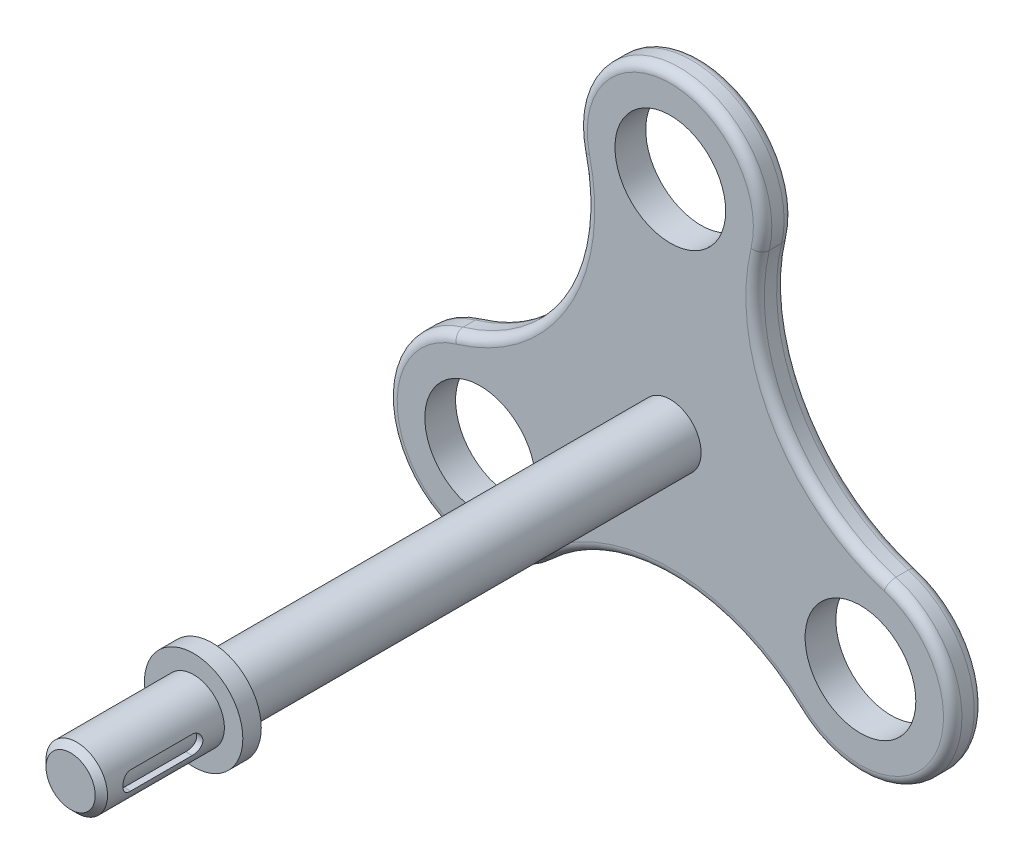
ISO-10303-21;
HEADER;
FILE_DESCRIPTION(('STEP AP214'),'2;1');
FILE_NAME('part.step','',(''),(''),'','','');
FILE_SCHEMA(('AUTOMOTIVE_DESIGN { 1 0 10303 214 1 1 1 1 }'));
ENDSEC;
DATA;
#1=APPLICATION_CONTEXT('core data for automotive mechanical design processes');
#2=APPLICATION_PROTOCOL_DEFINITION('international standard','automotive_design',2000,#1);
#3=PRODUCT_CONTEXT('',#1,'mechanical');
#4=PRODUCT('Part','Part','',(#3));
#5=PRODUCT_RELATED_PRODUCT_CATEGORY('part','',(#4));
#6=PRODUCT_DEFINITION_FORMATION('','',#4);
#7=PRODUCT_DEFINITION_CONTEXT('part definition',#1,'design');
#8=PRODUCT_DEFINITION('design','',#6,#7);
#9=PRODUCT_DEFINITION_SHAPE('','',#8);
#10=(LENGTH_UNIT() NAMED_UNIT(*) SI_UNIT(.MILLI.,.METRE.));
#11=(NAMED_UNIT(*) PLANE_ANGLE_UNIT() SI_UNIT($,.RADIAN.));
#12=(NAMED_UNIT(*) SI_UNIT($,.STERADIAN.) SOLID_ANGLE_UNIT());
#13=UNCERTAINTY_MEASURE_WITH_UNIT(LENGTH_MEASURE(1.E-05),#10,'distance_accuracy_value','');
#14=(GEOMETRIC_REPRESENTATION_CONTEXT(3) GLOBAL_UNCERTAINTY_ASSIGNED_CONTEXT((#13)) GLOBAL_UNIT_ASSIGNED_CONTEXT((#10,
#11,#12)) REPRESENTATION_CONTEXT('',''));
#15=CARTESIAN_POINT('',(0.,0.,0.));
#16=DIRECTION('',(0.,0.,1.));
#17=DIRECTION('',(1.,0.,0.));
#18=AXIS2_PLACEMENT_3D('',#15,#16,#17);
#19=CARTESIAN_POINT('',(15.4557654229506,-8.77017098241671,1.25));
#20=DIRECTION('',(0.,0.,-1.));
#21=DIRECTION('',(-1.,0.,0.));
#22=AXIS2_PLACEMENT_3D('',#19,#20,#21);
#23=CYLINDRICAL_SURFACE('',#22,7.5);
#24=DIRECTION('',(0.,0.,-1.));
#25=VECTOR('',#24,1.);
#26=CARTESIAN_POINT('',(10.3038436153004,-14.2206481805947,1.25));
#27=LINE('',#26,#25);
#28=CARTESIAN_POINT('',(10.3038436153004,-14.2206481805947,0.5));
#29=VERTEX_POINT('',#28);
#30=CARTESIAN_POINT('',(10.3038436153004,-14.2206481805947,-0.5));
#31=VERTEX_POINT('',#30);
#32=EDGE_CURVE('E342',#29,#31,#27,.T.);
#33=ORIENTED_EDGE('',*,*,#32,.T.);
#34=CARTESIAN_POINT('',(15.4557654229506,-8.77017098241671,-0.5));
#35=DIRECTION('',(0.,0.,1.));
#36=DIRECTION('',(1.,0.,0.));
#37=AXIS2_PLACEMENT_3D('',#34,#35,#36);
#38=CIRCLE('',#37,7.5);
#39=CARTESIAN_POINT('',(17.6000562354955,-1.5832372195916,-0.5));
#40=VERTEX_POINT('',#39);
#41=EDGE_CURVE('E315',#31,#40,#38,.T.);
#42=ORIENTED_EDGE('',*,*,#41,.T.);
#43=DIRECTION('',(0.,0.,-1.));
#44=VECTOR('',#43,1.);
#45=CARTESIAN_POINT('',(17.6000562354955,-1.5832372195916,1.25));
#46=LINE('',#45,#44);
#47=CARTESIAN_POINT('',(17.6000562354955,-1.5832372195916,0.5));
#48=VERTEX_POINT('',#47);
#49=EDGE_CURVE('E348',#48,#40,#46,.T.);
#50=ORIENTED_EDGE('',*,*,#49,.F.);
#51=CARTESIAN_POINT('',(15.4557654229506,-8.77017098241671,0.5));
#52=DIRECTION('',(0.,0.,1.));
#53=DIRECTION('',(1.,0.,0.));
#54=AXIS2_PLACEMENT_3D('',#51,#52,#53);
#55=CIRCLE('',#54,7.5);
#56=EDGE_CURVE('E317',#48,#29,#55,.F.);
#57=ORIENTED_EDGE('',*,*,#56,.T.);
#58=EDGE_LOOP('',(#33,#42,#50,#57));
#59=FACE_BOUND('',#58,.T.);
#60=ADVANCED_FACE('F58',(#59),#23,.T.);
#61=CARTESIAN_POINT('',(21.8886378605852,12.7906303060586,1.25));
#62=DIRECTION('',(0.,0.,-1.));
#63=DIRECTION('',(-1.,0.,0.));
#64=AXIS2_PLACEMENT_3D('',#61,#62,#63);
#65=CYLINDRICAL_SURFACE('',#64,15.);
#66=ORIENTED_EDGE('',*,*,#49,.T.);
#67=CARTESIAN_POINT('',(21.8886378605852,12.7906303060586,-0.5));
#68=DIRECTION('',(0.,0.,1.));
#69=DIRECTION('',(1.,0.,0.));
#70=AXIS2_PLACEMENT_3D('',#67,#68,#69);
#71=CIRCLE('',#70,15.);
#72=CARTESIAN_POINT('',(7.29621262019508,16.2635434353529,-0.5));
#73=VERTEX_POINT('',#72);
#74=EDGE_CURVE('E311',#40,#73,#71,.F.);
#75=ORIENTED_EDGE('',*,*,#74,.T.);
#76=DIRECTION('',(0.,0.,-1.));
#77=VECTOR('',#76,1.);
#78=CARTESIAN_POINT('',(7.29621262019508,16.2635434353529,1.25));
#79=LINE('',#78,#77);
#80=CARTESIAN_POINT('',(7.29621262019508,16.2635434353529,0.5));
#81=VERTEX_POINT('',#80);
#82=EDGE_CURVE('E351',#81,#73,#79,.T.);
#83=ORIENTED_EDGE('',*,*,#82,.F.);
#84=CARTESIAN_POINT('',(21.8886378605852,12.7906303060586,0.5));
#85=DIRECTION('',(0.,0.,1.));
#86=DIRECTION('',(1.,0.,0.));
#87=AXIS2_PLACEMENT_3D('',#84,#85,#86);
#88=CIRCLE('',#87,15.);
#89=EDGE_CURVE('E313',#81,#48,#88,.T.);
#90=ORIENTED_EDGE('',*,*,#89,.T.);
#91=EDGE_LOOP('',(#66,#75,#83,#90));
#92=FACE_BOUND('',#91,.T.);
#93=ADVANCED_FACE('F397',(#92),#65,.F.);
#94=CARTESIAN_POINT('',(0.,18.,1.25));
#95=DIRECTION('',(0.,0.,-1.));
#96=DIRECTION('',(-1.,0.,0.));
#97=AXIS2_PLACEMENT_3D('',#94,#95,#96);
#98=CYLINDRICAL_SURFACE('',#97,7.5);
#99=ORIENTED_EDGE('',*,*,#82,.T.);
#100=CARTESIAN_POINT('',(0.,18.,-0.5));
#101=DIRECTION('',(0.,0.,1.));
#102=DIRECTION('',(1.,0.,0.));
#103=AXIS2_PLACEMENT_3D('',#100,#101,#102);
#104=CIRCLE('',#103,7.5);
#105=CARTESIAN_POINT('',(-7.29621262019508,16.2635434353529,-0.5));
#106=VERTEX_POINT('',#105);
#107=EDGE_CURVE('E307',#73,#106,#104,.T.);
#108=ORIENTED_EDGE('',*,*,#107,.T.);
#109=DIRECTION('',(0.,0.,-1.));
#110=VECTOR('',#109,1.);
#111=CARTESIAN_POINT('',(-7.29621262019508,16.2635434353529,1.25));
#112=LINE('',#111,#110);
#113=CARTESIAN_POINT('',(-7.29621262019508,16.2635434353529,0.5));
#114=VERTEX_POINT('',#113);
#115=EDGE_CURVE('E354',#114,#106,#112,.T.);
#116=ORIENTED_EDGE('',*,*,#115,.F.);
#117=CARTESIAN_POINT('',(0.,18.,0.5));
#118=DIRECTION('',(0.,0.,1.));
#119=DIRECTION('',(1.,0.,0.));
#120=AXIS2_PLACEMENT_3D('',#117,#118,#119);
#121=CIRCLE('',#120,7.5);
#122=EDGE_CURVE('E309',#114,#81,#121,.F.);
#123=ORIENTED_EDGE('',*,*,#122,.T.);
#124=EDGE_LOOP('',(#99,#108,#116,#123));
#125=FACE_BOUND('',#124,.T.);
#126=ADVANCED_FACE('F403',(#125),#98,.T.);
#127=CARTESIAN_POINT('',(-21.8886378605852,12.7906303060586,1.25));
#128=DIRECTION('',(0.,0.,-1.));
#129=DIRECTION('',(-1.,0.,0.));
#130=AXIS2_PLACEMENT_3D('',#127,#128,#129);
#131=CYLINDRICAL_SURFACE('',#130,15.);
#132=ORIENTED_EDGE('',*,*,#115,.T.);
#133=CARTESIAN_POINT('',(-21.8886378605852,12.7906303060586,-0.5));
#134=DIRECTION('',(0.,0.,1.));
#135=DIRECTION('',(1.,0.,0.));
#136=AXIS2_PLACEMENT_3D('',#133,#134,#135);
#137=CIRCLE('',#136,15.);
#138=CARTESIAN_POINT('',(-17.6000562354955,-1.5832372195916,-0.5));
#139=VERTEX_POINT('',#138);
#140=EDGE_CURVE('E257',#106,#139,#137,.F.);
#141=ORIENTED_EDGE('',*,*,#140,.T.);
#142=DIRECTION('',(0.,0.,-1.));
#143=VECTOR('',#142,1.);
#144=CARTESIAN_POINT('',(-17.6000562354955,-1.5832372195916,1.25));
#145=LINE('',#144,#143);
#146=CARTESIAN_POINT('',(-17.6000562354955,-1.5832372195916,0.5));
#147=VERTEX_POINT('',#146);
#148=EDGE_CURVE('E357',#147,#139,#145,.T.);
#149=ORIENTED_EDGE('',*,*,#148,.F.);
#150=CARTESIAN_POINT('',(-21.8886378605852,12.7906303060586,0.5));
#151=DIRECTION('',(0.,0.,1.));
#152=DIRECTION('',(1.,0.,0.));
#153=AXIS2_PLACEMENT_3D('',#150,#151,#152);
#154=CIRCLE('',#153,15.);
#155=EDGE_CURVE('E292',#147,#114,#154,.T.);
#156=ORIENTED_EDGE('',*,*,#155,.T.);
#157=EDGE_LOOP('',(#132,#141,#149,#156));
#158=FACE_BOUND('',#157,.T.);
#159=ADVANCED_FACE('F518',(#158),#131,.F.);
#160=CARTESIAN_POINT('',(-15.4557654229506,-8.77017098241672,1.25));
#161=DIRECTION('',(0.,0.,-1.));
#162=DIRECTION('',(-1.,0.,0.));
#163=AXIS2_PLACEMENT_3D('',#160,#161,#162);
#164=CYLINDRICAL_SURFACE('',#163,7.5);
#165=ORIENTED_EDGE('',*,*,#148,.T.);
#166=CARTESIAN_POINT('',(-15.4557654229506,-8.77017098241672,-0.5));
#167=DIRECTION('',(0.,0.,1.));
#168=DIRECTION('',(1.,0.,0.));
#169=AXIS2_PLACEMENT_3D('',#166,#167,#168);
#170=CIRCLE('',#169,7.5);
#171=CARTESIAN_POINT('',(-10.3038436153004,-14.2206481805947,-0.5));
#172=VERTEX_POINT('',#171);
#173=EDGE_CURVE('E323',#139,#172,#170,.T.);
#174=ORIENTED_EDGE('',*,*,#173,.T.);
#175=DIRECTION('',(0.,0.,-1.));
#176=VECTOR('',#175,1.);
#177=CARTESIAN_POINT('',(-10.3038436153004,-14.2206481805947,1.25));
#178=LINE('',#177,#176);
#179=CARTESIAN_POINT('',(-10.3038436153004,-14.2206481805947,0.5));
#180=VERTEX_POINT('',#179);
#181=EDGE_CURVE('E360',#180,#172,#178,.T.);
#182=ORIENTED_EDGE('',*,*,#181,.F.);
#183=CARTESIAN_POINT('',(-15.4557654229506,-8.77017098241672,0.5));
#184=DIRECTION('',(0.,0.,1.));
#185=DIRECTION('',(1.,0.,0.));
#186=AXIS2_PLACEMENT_3D('',#183,#184,#185);
#187=CIRCLE('',#186,7.5);
#188=EDGE_CURVE('E326',#180,#147,#187,.F.);
#189=ORIENTED_EDGE('',*,*,#188,.T.);
#190=EDGE_LOOP('',(#165,#174,#182,#189));
#191=FACE_BOUND('',#190,.T.);
#192=ADVANCED_FACE('F412',(#191),#164,.T.);
#193=CARTESIAN_POINT('',(0.,-25.1216025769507,1.25));
#194=DIRECTION('',(0.,0.,-1.));
#195=DIRECTION('',(-1.,0.,0.));
#196=AXIS2_PLACEMENT_3D('',#193,#194,#195);
#197=CYLINDRICAL_SURFACE('',#196,15.);
#198=ORIENTED_EDGE('',*,*,#181,.T.);
#199=CARTESIAN_POINT('',(0.,-25.1216025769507,-0.5));
#200=DIRECTION('',(0.,0.,1.));
#201=DIRECTION('',(1.,0.,0.));
#202=AXIS2_PLACEMENT_3D('',#199,#200,#201);
#203=CIRCLE('',#202,15.);
#204=EDGE_CURVE('E319',#172,#31,#203,.F.);
#205=ORIENTED_EDGE('',*,*,#204,.T.);
#206=ORIENTED_EDGE('',*,*,#32,.F.);
#207=CARTESIAN_POINT('',(0.,-25.1216025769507,0.5));
#208=DIRECTION('',(0.,0.,1.));
#209=DIRECTION('',(1.,0.,0.));
#210=AXIS2_PLACEMENT_3D('',#207,#208,#209);
#211=CIRCLE('',#210,15.);
#212=EDGE_CURVE('E321',#29,#180,#211,.T.);
#213=ORIENTED_EDGE('',*,*,#212,.T.);
#214=EDGE_LOOP('',(#198,#205,#206,#213));
#215=FACE_BOUND('',#214,.T.);
#216=ADVANCED_FACE('F408',(#215),#197,.F.);
#217=CARTESIAN_POINT('',(-15.4557654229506,-8.77017098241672,1.25));
#218=DIRECTION('',(0.,0.,-1.));
#219=DIRECTION('',(-1.,0.,0.));
#220=AXIS2_PLACEMENT_3D('',#217,#218,#219);
#221=CYLINDRICAL_SURFACE('',#220,4.5);
#222=CARTESIAN_POINT('',(-15.4557654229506,-8.77017098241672,1.25));
#223=DIRECTION('',(0.,0.,1.));
#224=DIRECTION('',(1.,0.,0.));
#225=AXIS2_PLACEMENT_3D('',#222,#223,#224);
#226=CIRCLE('',#225,4.5);
#227=CARTESIAN_POINT('',(-10.9557654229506,-8.77017098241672,1.25));
#228=VERTEX_POINT('',#227);
#229=EDGE_CURVE('E363',#228,#228,#226,.T.);
#230=ORIENTED_EDGE('',*,*,#229,.T.);
#231=EDGE_LOOP('',(#230));
#232=FACE_BOUND('',#231,.T.);
#233=CARTESIAN_POINT('',(-15.4557654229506,-8.77017098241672,-1.25));
#234=DIRECTION('',(0.,0.,1.));
#235=DIRECTION('',(1.,0.,0.));
#236=AXIS2_PLACEMENT_3D('',#233,#234,#235);
#237=CIRCLE('',#236,4.5);
#238=CARTESIAN_POINT('',(-10.9557654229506,-8.77017098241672,-1.25));
#239=VERTEX_POINT('',#238);
#240=EDGE_CURVE('E364',#239,#239,#237,.T.);
#241=ORIENTED_EDGE('',*,*,#240,.F.);
#242=EDGE_LOOP('',(#241));
#243=FACE_BOUND('',#242,.T.);
#244=ADVANCED_FACE('F411',(#232,#243),#221,.F.);
#245=CARTESIAN_POINT('',(15.4557654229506,-8.77017098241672,1.25));
#246=DIRECTION('',(0.,0.,-1.));
#247=DIRECTION('',(-1.,0.,0.));
#248=AXIS2_PLACEMENT_3D('',#245,#246,#247);
#249=CYLINDRICAL_SURFACE('',#248,4.5);
#250=CARTESIAN_POINT('',(15.4557654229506,-8.77017098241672,1.25));
#251=DIRECTION('',(0.,0.,1.));
#252=DIRECTION('',(1.,0.,0.));
#253=AXIS2_PLACEMENT_3D('',#250,#251,#252);
#254=CIRCLE('',#253,4.5);
#255=CARTESIAN_POINT('',(19.9557654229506,-8.77017098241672,1.25));
#256=VERTEX_POINT('',#255);
#257=EDGE_CURVE('E375',#256,#256,#254,.T.);
#258=ORIENTED_EDGE('',*,*,#257,.T.);
#259=EDGE_LOOP('',(#258));
#260=FACE_BOUND('',#259,.T.);
#261=CARTESIAN_POINT('',(15.4557654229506,-8.77017098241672,-1.25));
#262=DIRECTION('',(0.,0.,1.));
#263=DIRECTION('',(1.,0.,0.));
#264=AXIS2_PLACEMENT_3D('',#261,#262,#263);
#265=CIRCLE('',#264,4.5);
#266=CARTESIAN_POINT('',(19.9557654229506,-8.77017098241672,-1.25));
#267=VERTEX_POINT('',#266);
#268=EDGE_CURVE('E368',#267,#267,#265,.T.);
#269=ORIENTED_EDGE('',*,*,#268,.F.);
#270=EDGE_LOOP('',(#269));
#271=FACE_BOUND('',#270,.T.);
#272=ADVANCED_FACE('F416',(#260,#271),#249,.F.);
#273=CARTESIAN_POINT('',(0.,18.,1.25));
#274=DIRECTION('',(0.,0.,-1.));
#275=DIRECTION('',(-1.,0.,0.));
#276=AXIS2_PLACEMENT_3D('',#273,#274,#275);
#277=CYLINDRICAL_SURFACE('',#276,4.5);
#278=CARTESIAN_POINT('',(0.,18.,1.25));
#279=DIRECTION('',(0.,0.,1.));
#280=DIRECTION('',(1.,0.,0.));
#281=AXIS2_PLACEMENT_3D('',#278,#279,#280);
#282=CIRCLE('',#281,4.5);
#283=CARTESIAN_POINT('',(4.5,18.,1.25));
#284=VERTEX_POINT('',#283);
#285=EDGE_CURVE('E367',#284,#284,#282,.T.);
#286=ORIENTED_EDGE('',*,*,#285,.T.);
#287=EDGE_LOOP('',(#286));
#288=FACE_BOUND('',#287,.T.);
#289=CARTESIAN_POINT('',(0.,18.,-1.25));
#290=DIRECTION('',(0.,0.,1.));
#291=DIRECTION('',(1.,0.,0.));
#292=AXIS2_PLACEMENT_3D('',#289,#290,#291);
#293=CIRCLE('',#292,4.5);
#294=CARTESIAN_POINT('',(4.5,18.,-1.25));
#295=VERTEX_POINT('',#294);
#296=EDGE_CURVE('E345',#295,#295,#293,.T.);
#297=ORIENTED_EDGE('',*,*,#296,.F.);
#298=EDGE_LOOP('',(#297));
#299=FACE_BOUND('',#298,.T.);
#300=ADVANCED_FACE('F420',(#288,#299),#277,.F.);
#301=CARTESIAN_POINT('',(0.,0.,-1.25));
#302=DIRECTION('',(0.,0.,1.));
#303=DIRECTION('',(1.,0.,0.));
#304=AXIS2_PLACEMENT_3D('',#301,#302,#303);
#305=PLANE('',#304);
#306=CARTESIAN_POINT('',(0.,-25.1216025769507,-1.25));
#307=DIRECTION('',(0.,0.,1.));
#308=DIRECTION('',(1.,0.,0.));
#309=AXIS2_PLACEMENT_3D('',#306,#307,#308);
#310=CIRCLE('',#309,15.75);
#311=CARTESIAN_POINT('',(10.8190357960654,-13.6756004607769,-1.25));
#312=VERTEX_POINT('',#311);
#313=CARTESIAN_POINT('',(-10.8190357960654,-13.6756004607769,-1.25));
#314=VERTEX_POINT('',#313);
#315=EDGE_CURVE('E332',#312,#314,#310,.T.);
#316=ORIENTED_EDGE('',*,*,#315,.T.);
#317=CARTESIAN_POINT('',(-15.4557654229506,-8.77017098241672,-1.25));
#318=DIRECTION('',(0.,0.,1.));
#319=DIRECTION('',(1.,0.,0.));
#320=AXIS2_PLACEMENT_3D('',#317,#318,#319);
#321=CIRCLE('',#320,6.75);
#322=CARTESIAN_POINT('',(-17.385627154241,-2.30193059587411,-1.25));
#323=VERTEX_POINT('',#322);
#324=EDGE_CURVE('E329',#314,#323,#321,.F.);
#325=ORIENTED_EDGE('',*,*,#324,.T.);
#326=CARTESIAN_POINT('',(-21.8886378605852,12.7906303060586,-1.25));
#327=DIRECTION('',(0.,0.,1.));
#328=DIRECTION('',(1.,0.,0.));
#329=AXIS2_PLACEMENT_3D('',#326,#327,#328);
#330=CIRCLE('',#329,15.75);
#331=CARTESIAN_POINT('',(-6.56659135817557,16.4371890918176,-1.25));
#332=VERTEX_POINT('',#331);
#333=EDGE_CURVE('E340',#323,#332,#330,.T.);
#334=ORIENTED_EDGE('',*,*,#333,.T.);
#335=CARTESIAN_POINT('',(0.,18.,-1.25));
#336=DIRECTION('',(0.,0.,1.));
#337=DIRECTION('',(1.,0.,0.));
#338=AXIS2_PLACEMENT_3D('',#335,#336,#337);
#339=CIRCLE('',#338,6.75);
#340=CARTESIAN_POINT('',(6.56659135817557,16.4371890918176,-1.25));
#341=VERTEX_POINT('',#340);
#342=EDGE_CURVE('E338',#332,#341,#339,.F.);
#343=ORIENTED_EDGE('',*,*,#342,.T.);
#344=CARTESIAN_POINT('',(21.8886378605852,12.7906303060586,-1.25));
#345=DIRECTION('',(0.,0.,1.));
#346=DIRECTION('',(1.,0.,0.));
#347=AXIS2_PLACEMENT_3D('',#344,#345,#346);
#348=CIRCLE('',#347,15.75);
#349=CARTESIAN_POINT('',(17.385627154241,-2.30193059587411,-1.25));
#350=VERTEX_POINT('',#349);
#351=EDGE_CURVE('E336',#341,#350,#348,.T.);
#352=ORIENTED_EDGE('',*,*,#351,.T.);
#353=CARTESIAN_POINT('',(15.4557654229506,-8.77017098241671,-1.25));
#354=DIRECTION('',(0.,0.,1.));
#355=DIRECTION('',(1.,0.,0.));
#356=AXIS2_PLACEMENT_3D('',#353,#354,#355);
#357=CIRCLE('',#356,6.75);
#358=EDGE_CURVE('E334',#350,#312,#357,.F.);
#359=ORIENTED_EDGE('',*,*,#358,.T.);
#360=EDGE_LOOP('',(#316,#325,#334,#343,#352,#359));
#361=FACE_BOUND('',#360,.T.);
#362=ORIENTED_EDGE('',*,*,#296,.T.);
#363=EDGE_LOOP('',(#362));
#364=FACE_BOUND('',#363,.T.);
#365=ORIENTED_EDGE('',*,*,#268,.T.);
#366=EDGE_LOOP('',(#365));
#367=FACE_BOUND('',#366,.T.);
#368=ORIENTED_EDGE('',*,*,#240,.T.);
#369=EDGE_LOOP('',(#368));
#370=FACE_BOUND('',#369,.T.);
#371=ADVANCED_FACE('F424',(#361,#364,#367,#370),#305,.F.);
#372=CARTESIAN_POINT('',(0.,0.,1.25));
#373=DIRECTION('',(0.,0.,1.));
#374=DIRECTION('',(1.,0.,0.));
#375=AXIS2_PLACEMENT_3D('',#372,#373,#374);
#376=PLANE('',#375);
#377=CARTESIAN_POINT('',(-21.8886378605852,12.7906303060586,1.25));
#378=DIRECTION('',(0.,0.,1.));
#379=DIRECTION('',(1.,0.,0.));
#380=AXIS2_PLACEMENT_3D('',#377,#378,#379);
#381=CIRCLE('',#380,15.75);
#382=CARTESIAN_POINT('',(-6.56659135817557,16.4371890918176,1.25));
#383=VERTEX_POINT('',#382);
#384=CARTESIAN_POINT('',(-17.385627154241,-2.30193059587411,1.25));
#385=VERTEX_POINT('',#384);
#386=EDGE_CURVE('E305',#383,#385,#381,.F.);
#387=ORIENTED_EDGE('',*,*,#386,.T.);
#388=CARTESIAN_POINT('',(-15.4557654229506,-8.77017098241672,1.25));
#389=DIRECTION('',(0.,0.,1.));
#390=DIRECTION('',(1.,0.,0.));
#391=AXIS2_PLACEMENT_3D('',#388,#389,#390);
#392=CIRCLE('',#391,6.75);
#393=CARTESIAN_POINT('',(-10.8190357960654,-13.6756004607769,1.25));
#394=VERTEX_POINT('',#393);
#395=EDGE_CURVE('E294',#385,#394,#392,.T.);
#396=ORIENTED_EDGE('',*,*,#395,.T.);
#397=CARTESIAN_POINT('',(0.,-25.1216025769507,1.25));
#398=DIRECTION('',(0.,0.,1.));
#399=DIRECTION('',(1.,0.,0.));
#400=AXIS2_PLACEMENT_3D('',#397,#398,#399);
#401=CIRCLE('',#400,15.75);
#402=CARTESIAN_POINT('',(10.8190357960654,-13.6756004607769,1.25));
#403=VERTEX_POINT('',#402);
#404=EDGE_CURVE('E297',#394,#403,#401,.F.);
#405=ORIENTED_EDGE('',*,*,#404,.T.);
#406=CARTESIAN_POINT('',(15.4557654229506,-8.77017098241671,1.25));
#407=DIRECTION('',(0.,0.,1.));
#408=DIRECTION('',(1.,0.,0.));
#409=AXIS2_PLACEMENT_3D('',#406,#407,#408);
#410=CIRCLE('',#409,6.75);
#411=CARTESIAN_POINT('',(17.385627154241,-2.30193059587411,1.25));
#412=VERTEX_POINT('',#411);
#413=EDGE_CURVE('E299',#403,#412,#410,.T.);
#414=ORIENTED_EDGE('',*,*,#413,.T.);
#415=CARTESIAN_POINT('',(21.8886378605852,12.7906303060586,1.25));
#416=DIRECTION('',(0.,0.,1.));
#417=DIRECTION('',(1.,0.,0.));
#418=AXIS2_PLACEMENT_3D('',#415,#416,#417);
#419=CIRCLE('',#418,15.75);
#420=CARTESIAN_POINT('',(6.56659135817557,16.4371890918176,1.25));
#421=VERTEX_POINT('',#420);
#422=EDGE_CURVE('E301',#412,#421,#419,.F.);
#423=ORIENTED_EDGE('',*,*,#422,.T.);
#424=CARTESIAN_POINT('',(0.,18.,1.25));
#425=DIRECTION('',(0.,0.,1.));
#426=DIRECTION('',(1.,0.,0.));
#427=AXIS2_PLACEMENT_3D('',#424,#425,#426);
#428=CIRCLE('',#427,6.75);
#429=EDGE_CURVE('E303',#421,#383,#428,.T.);
#430=ORIENTED_EDGE('',*,*,#429,.T.);
#431=EDGE_LOOP('',(#387,#396,#405,#414,#423,#430));
#432=FACE_BOUND('',#431,.T.);
#433=CARTESIAN_POINT('',(0.,0.,1.25));
#434=DIRECTION('',(0.,0.,1.));
#435=DIRECTION('',(1.,0.,0.));
#436=AXIS2_PLACEMENT_3D('',#433,#434,#435);
#437=CIRCLE('',#436,2.5);
#438=CARTESIAN_POINT('',(2.5,0.,1.25));
#439=VERTEX_POINT('',#438);
#440=EDGE_CURVE('E278',#439,#439,#437,.F.);
#441=ORIENTED_EDGE('',*,*,#440,.T.);
#442=EDGE_LOOP('',(#441));
#443=FACE_BOUND('',#442,.T.);
#444=ORIENTED_EDGE('',*,*,#285,.F.);
#445=EDGE_LOOP('',(#444));
#446=FACE_BOUND('',#445,.T.);
#447=ORIENTED_EDGE('',*,*,#257,.F.);
#448=EDGE_LOOP('',(#447));
#449=FACE_BOUND('',#448,.T.);
#450=ORIENTED_EDGE('',*,*,#229,.F.);
#451=EDGE_LOOP('',(#450));
#452=FACE_BOUND('',#451,.T.);
#453=ADVANCED_FACE('F235',(#432,#443,#446,#449,#452),#376,.T.);
#454=CARTESIAN_POINT('',(0.,0.,50.));
#455=DIRECTION('',(0.,0.,-1.));
#456=DIRECTION('',(-1.,0.,0.));
#457=AXIS2_PLACEMENT_3D('',#454,#455,#456);
#458=CYLINDRICAL_SURFACE('',#457,2.5);
#459=CARTESIAN_POINT('',(0.,0.,38.5));
#460=DIRECTION('',(0.,0.,1.));
#461=DIRECTION('',(1.,0.,0.));
#462=AXIS2_PLACEMENT_3D('',#459,#460,#461);
#463=CIRCLE('',#462,2.5);
#464=CARTESIAN_POINT('',(2.5,0.,38.5));
#465=VERTEX_POINT('',#464);
#466=EDGE_CURVE('E385',#465,#465,#463,.T.);
#467=ORIENTED_EDGE('',*,*,#466,.F.);
#468=EDGE_LOOP('',(#467));
#469=FACE_BOUND('',#468,.T.);
#470=ORIENTED_EDGE('',*,*,#440,.F.);
#471=EDGE_LOOP('',(#470));
#472=FACE_BOUND('',#471,.T.);
#473=ADVANCED_FACE('F229',(#469,#472),#458,.T.);
#474=CARTESIAN_POINT('',(21.8886378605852,12.7906303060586,-0.5));
#475=DIRECTION('',(0.,0.,1.));
#476=DIRECTION('',(1.,0.,0.));
#477=AXIS2_PLACEMENT_3D('',#474,#475,#476);
#478=TOROIDAL_SURFACE('',#477,15.75,0.75);
#479=CARTESIAN_POINT('',(6.56659135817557,16.4371890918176,-0.5));
#480=DIRECTION('',(0.23152754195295,0.972828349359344,0.));
#481=DIRECTION('',(-0.972828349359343,0.23152754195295,0.));
#482=AXIS2_PLACEMENT_3D('',#479,#480,#481);
#483=CIRCLE('',#482,0.75);
#484=EDGE_CURVE('E279',#73,#341,#483,.T.);
#485=ORIENTED_EDGE('',*,*,#484,.F.);
#486=ORIENTED_EDGE('',*,*,#74,.F.);
#487=CARTESIAN_POINT('',(17.385627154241,-2.30193059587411,-0.5));
#488=DIRECTION('',(0.958257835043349,-0.285905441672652,0.));
#489=DIRECTION('',(0.285905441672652,0.958257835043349,0.));
#490=AXIS2_PLACEMENT_3D('',#487,#488,#489);
#491=CIRCLE('',#490,0.75);
#492=EDGE_CURVE('E275',#350,#40,#491,.T.);
#493=ORIENTED_EDGE('',*,*,#492,.F.);
#494=ORIENTED_EDGE('',*,*,#351,.F.);
#495=EDGE_LOOP('',(#485,#486,#493,#494));
#496=FACE_BOUND('',#495,.T.);
#497=ADVANCED_FACE('F234',(#496),#478,.T.);
#498=CARTESIAN_POINT('',(15.4557654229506,-8.77017098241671,-0.5));
#499=DIRECTION('',(0.,0.,1.));
#500=DIRECTION('',(1.,0.,0.));
#501=AXIS2_PLACEMENT_3D('',#498,#499,#500);
#502=TOROIDAL_SURFACE('',#501,6.75,0.75);
#503=ORIENTED_EDGE('',*,*,#492,.T.);
#504=ORIENTED_EDGE('',*,*,#41,.F.);
#505=CARTESIAN_POINT('',(10.8190357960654,-13.6756004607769,-0.5));
#506=DIRECTION('',(-0.7267302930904,0.686922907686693,0.));
#507=DIRECTION('',(-0.686922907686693,-0.7267302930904,0.));
#508=AXIS2_PLACEMENT_3D('',#505,#506,#507);
#509=CIRCLE('',#508,0.75);
#510=EDGE_CURVE('E282',#312,#31,#509,.T.);
#511=ORIENTED_EDGE('',*,*,#510,.F.);
#512=ORIENTED_EDGE('',*,*,#358,.F.);
#513=EDGE_LOOP('',(#503,#504,#511,#512));
#514=FACE_BOUND('',#513,.T.);
#515=ADVANCED_FACE('F442',(#514),#502,.T.);
#516=CARTESIAN_POINT('',(0.,18.,-0.5));
#517=DIRECTION('',(0.,0.,1.));
#518=DIRECTION('',(1.,0.,0.));
#519=AXIS2_PLACEMENT_3D('',#516,#517,#518);
#520=TOROIDAL_SURFACE('',#519,6.75,0.75);
#521=ORIENTED_EDGE('',*,*,#484,.T.);
#522=ORIENTED_EDGE('',*,*,#342,.F.);
#523=CARTESIAN_POINT('',(-6.56659135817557,16.4371890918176,-0.5));
#524=DIRECTION('',(0.23152754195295,-0.972828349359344,0.));
#525=DIRECTION('',(0.972828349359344,0.23152754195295,0.));
#526=AXIS2_PLACEMENT_3D('',#523,#524,#525);
#527=CIRCLE('',#526,0.75);
#528=EDGE_CURVE('E285',#106,#332,#527,.T.);
#529=ORIENTED_EDGE('',*,*,#528,.F.);
#530=ORIENTED_EDGE('',*,*,#107,.F.);
#531=EDGE_LOOP('',(#521,#522,#529,#530));
#532=FACE_BOUND('',#531,.T.);
#533=ADVANCED_FACE('F438',(#532),#520,.T.);
#534=CARTESIAN_POINT('',(0.,-25.1216025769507,-0.5));
#535=DIRECTION('',(0.,0.,1.));
#536=DIRECTION('',(1.,0.,0.));
#537=AXIS2_PLACEMENT_3D('',#534,#535,#536);
#538=TOROIDAL_SURFACE('',#537,15.75,0.75);
#539=ORIENTED_EDGE('',*,*,#510,.T.);
#540=ORIENTED_EDGE('',*,*,#204,.F.);
#541=CARTESIAN_POINT('',(-10.8190357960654,-13.6756004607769,-0.5));
#542=DIRECTION('',(-0.7267302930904,-0.686922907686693,0.));
#543=DIRECTION('',(0.686922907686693,-0.7267302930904,0.));
#544=AXIS2_PLACEMENT_3D('',#541,#542,#543);
#545=CIRCLE('',#544,0.75);
#546=EDGE_CURVE('E288',#314,#172,#545,.T.);
#547=ORIENTED_EDGE('',*,*,#546,.F.);
#548=ORIENTED_EDGE('',*,*,#315,.F.);
#549=EDGE_LOOP('',(#539,#540,#547,#548));
#550=FACE_BOUND('',#549,.T.);
#551=ADVANCED_FACE('F434',(#550),#538,.T.);
#552=CARTESIAN_POINT('',(-21.8886378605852,12.7906303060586,-0.5));
#553=DIRECTION('',(0.,0.,1.));
#554=DIRECTION('',(1.,0.,0.));
#555=AXIS2_PLACEMENT_3D('',#552,#553,#554);
#556=TOROIDAL_SURFACE('',#555,15.75,0.75);
#557=ORIENTED_EDGE('',*,*,#528,.T.);
#558=ORIENTED_EDGE('',*,*,#333,.F.);
#559=CARTESIAN_POINT('',(-17.385627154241,-2.30193059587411,-0.5));
#560=DIRECTION('',(-0.958257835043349,-0.285905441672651,0.));
#561=DIRECTION('',(0.285905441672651,-0.958257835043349,0.));
#562=AXIS2_PLACEMENT_3D('',#559,#560,#561);
#563=CIRCLE('',#562,0.75);
#564=EDGE_CURVE('E261',#139,#323,#563,.T.);
#565=ORIENTED_EDGE('',*,*,#564,.F.);
#566=ORIENTED_EDGE('',*,*,#140,.F.);
#567=EDGE_LOOP('',(#557,#558,#565,#566));
#568=FACE_BOUND('',#567,.T.);
#569=ADVANCED_FACE('F430',(#568),#556,.T.);
#570=CARTESIAN_POINT('',(-15.4557654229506,-8.77017098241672,-0.5));
#571=DIRECTION('',(0.,0.,1.));
#572=DIRECTION('',(1.,0.,0.));
#573=AXIS2_PLACEMENT_3D('',#570,#571,#572);
#574=TOROIDAL_SURFACE('',#573,6.75,0.75);
#575=ORIENTED_EDGE('',*,*,#546,.T.);
#576=ORIENTED_EDGE('',*,*,#173,.F.);
#577=ORIENTED_EDGE('',*,*,#564,.T.);
#578=ORIENTED_EDGE('',*,*,#324,.F.);
#579=EDGE_LOOP('',(#575,#576,#577,#578));
#580=FACE_BOUND('',#579,.T.);
#581=ADVANCED_FACE('F426',(#580),#574,.T.);
#582=CARTESIAN_POINT('',(21.8886378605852,12.7906303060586,0.5));
#583=DIRECTION('',(0.,0.,1.));
#584=DIRECTION('',(1.,0.,0.));
#585=AXIS2_PLACEMENT_3D('',#582,#583,#584);
#586=TOROIDAL_SURFACE('',#585,15.75,0.75);
#587=CARTESIAN_POINT('',(6.56659135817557,16.4371890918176,0.5));
#588=DIRECTION('',(0.23152754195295,0.972828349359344,0.));
#589=DIRECTION('',(-0.972828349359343,0.23152754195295,0.));
#590=AXIS2_PLACEMENT_3D('',#587,#588,#589);
#591=CIRCLE('',#590,0.75);
#592=EDGE_CURVE('E262',#421,#81,#591,.T.);
#593=ORIENTED_EDGE('',*,*,#592,.F.);
#594=ORIENTED_EDGE('',*,*,#422,.F.);
#595=CARTESIAN_POINT('',(17.385627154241,-2.30193059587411,0.5));
#596=DIRECTION('',(0.958257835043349,-0.28590544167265,0.));
#597=DIRECTION('',(0.28590544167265,0.958257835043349,0.));
#598=AXIS2_PLACEMENT_3D('',#595,#596,#597);
#599=CIRCLE('',#598,0.75);
#600=EDGE_CURVE('E258',#48,#412,#599,.T.);
#601=ORIENTED_EDGE('',*,*,#600,.F.);
#602=ORIENTED_EDGE('',*,*,#89,.F.);
#603=EDGE_LOOP('',(#593,#594,#601,#602));
#604=FACE_BOUND('',#603,.T.);
#605=ADVANCED_FACE('F429',(#604),#586,.T.);
#606=CARTESIAN_POINT('',(15.4557654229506,-8.77017098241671,0.5));
#607=DIRECTION('',(0.,0.,1.));
#608=DIRECTION('',(1.,0.,0.));
#609=AXIS2_PLACEMENT_3D('',#606,#607,#608);
#610=TOROIDAL_SURFACE('',#609,6.75,0.75);
#611=ORIENTED_EDGE('',*,*,#600,.T.);
#612=ORIENTED_EDGE('',*,*,#413,.F.);
#613=CARTESIAN_POINT('',(10.8190357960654,-13.6756004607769,0.5));
#614=DIRECTION('',(-0.7267302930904,0.686922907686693,0.));
#615=DIRECTION('',(-0.686922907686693,-0.7267302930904,0.));
#616=AXIS2_PLACEMENT_3D('',#613,#614,#615);
#617=CIRCLE('',#616,0.75);
#618=EDGE_CURVE('E265',#29,#403,#617,.T.);
#619=ORIENTED_EDGE('',*,*,#618,.F.);
#620=ORIENTED_EDGE('',*,*,#56,.F.);
#621=EDGE_LOOP('',(#611,#612,#619,#620));
#622=FACE_BOUND('',#621,.T.);
#623=ADVANCED_FACE('F465',(#622),#610,.T.);
#624=CARTESIAN_POINT('',(0.,18.,0.5));
#625=DIRECTION('',(0.,0.,1.));
#626=DIRECTION('',(1.,0.,0.));
#627=AXIS2_PLACEMENT_3D('',#624,#625,#626);
#628=TOROIDAL_SURFACE('',#627,6.75,0.75);
#629=ORIENTED_EDGE('',*,*,#592,.T.);
#630=ORIENTED_EDGE('',*,*,#122,.F.);
#631=CARTESIAN_POINT('',(-6.56659135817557,16.4371890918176,0.5));
#632=DIRECTION('',(0.23152754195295,-0.972828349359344,0.));
#633=DIRECTION('',(0.972828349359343,0.23152754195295,0.));
#634=AXIS2_PLACEMENT_3D('',#631,#632,#633);
#635=CIRCLE('',#634,0.75);
#636=EDGE_CURVE('E268',#383,#114,#635,.T.);
#637=ORIENTED_EDGE('',*,*,#636,.F.);
#638=ORIENTED_EDGE('',*,*,#429,.F.);
#639=EDGE_LOOP('',(#629,#630,#637,#638));
#640=FACE_BOUND('',#639,.T.);
#641=ADVANCED_FACE('F461',(#640),#628,.T.);
#642=CARTESIAN_POINT('',(0.,-25.1216025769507,0.5));
#643=DIRECTION('',(0.,0.,1.));
#644=DIRECTION('',(1.,0.,0.));
#645=AXIS2_PLACEMENT_3D('',#642,#643,#644);
#646=TOROIDAL_SURFACE('',#645,15.75,0.75);
#647=ORIENTED_EDGE('',*,*,#618,.T.);
#648=ORIENTED_EDGE('',*,*,#404,.F.);
#649=CARTESIAN_POINT('',(-10.8190357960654,-13.6756004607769,0.5));
#650=DIRECTION('',(-0.726730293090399,-0.686922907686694,0.));
#651=DIRECTION('',(0.686922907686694,-0.726730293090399,0.));
#652=AXIS2_PLACEMENT_3D('',#649,#650,#651);
#653=CIRCLE('',#652,0.75);
#654=EDGE_CURVE('E81',#180,#394,#653,.T.);
#655=ORIENTED_EDGE('',*,*,#654,.F.);
#656=ORIENTED_EDGE('',*,*,#212,.F.);
#657=EDGE_LOOP('',(#647,#648,#655,#656));
#658=FACE_BOUND('',#657,.T.);
#659=ADVANCED_FACE('F457',(#658),#646,.T.);
#660=CARTESIAN_POINT('',(-21.8886378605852,12.7906303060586,0.5));
#661=DIRECTION('',(0.,0.,1.));
#662=DIRECTION('',(1.,0.,0.));
#663=AXIS2_PLACEMENT_3D('',#660,#661,#662);
#664=TOROIDAL_SURFACE('',#663,15.75,0.75);
#665=ORIENTED_EDGE('',*,*,#636,.T.);
#666=ORIENTED_EDGE('',*,*,#155,.F.);
#667=CARTESIAN_POINT('',(-17.385627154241,-2.30193059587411,0.5));
#668=DIRECTION('',(-0.958257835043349,-0.28590544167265,0.));
#669=DIRECTION('',(0.28590544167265,-0.958257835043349,0.));
#670=AXIS2_PLACEMENT_3D('',#667,#668,#669);
#671=CIRCLE('',#670,0.75);
#672=EDGE_CURVE('E272',#385,#147,#671,.T.);
#673=ORIENTED_EDGE('',*,*,#672,.F.);
#674=ORIENTED_EDGE('',*,*,#386,.F.);
#675=EDGE_LOOP('',(#665,#666,#673,#674));
#676=FACE_BOUND('',#675,.T.);
#677=ADVANCED_FACE('F454',(#676),#664,.T.);
#678=CARTESIAN_POINT('',(-15.4557654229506,-8.77017098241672,0.5));
#679=DIRECTION('',(0.,0.,1.));
#680=DIRECTION('',(1.,0.,0.));
#681=AXIS2_PLACEMENT_3D('',#678,#679,#680);
#682=TOROIDAL_SURFACE('',#681,6.75,0.75);
#683=ORIENTED_EDGE('',*,*,#654,.T.);
#684=ORIENTED_EDGE('',*,*,#395,.F.);
#685=ORIENTED_EDGE('',*,*,#672,.T.);
#686=ORIENTED_EDGE('',*,*,#188,.F.);
#687=EDGE_LOOP('',(#683,#684,#685,#686));
#688=FACE_BOUND('',#687,.T.);
#689=ADVANCED_FACE('F450',(#688),#682,.T.);
#690=CARTESIAN_POINT('',(0.,0.,38.5));
#691=DIRECTION('',(0.,0.,-1.));
#692=DIRECTION('',(-1.,0.,0.));
#693=AXIS2_PLACEMENT_3D('',#690,#691,#692);
#694=PLANE('',#693);
#695=ORIENTED_EDGE('',*,*,#466,.T.);
#696=EDGE_LOOP('',(#695));
#697=FACE_BOUND('',#696,.T.);
#698=CARTESIAN_POINT('',(0.,0.,38.5));
#699=DIRECTION('',(0.,0.,1.));
#700=DIRECTION('',(1.,0.,0.));
#701=AXIS2_PLACEMENT_3D('',#698,#699,#700);
#702=CIRCLE('',#701,4.);
#703=CARTESIAN_POINT('',(4.,0.,38.5));
#704=VERTEX_POINT('',#703);
#705=EDGE_CURVE('E274',#704,#704,#702,.T.);
#706=ORIENTED_EDGE('',*,*,#705,.F.);
#707=EDGE_LOOP('',(#706));
#708=FACE_BOUND('',#707,.T.);
#709=ADVANCED_FACE('F453',(#697,#708),#694,.T.);
#710=CARTESIAN_POINT('',(0.,0.,50.));
#711=DIRECTION('',(0.,0.,1.));
#712=DIRECTION('',(1.,0.,0.));
#713=AXIS2_PLACEMENT_3D('',#710,#711,#712);
#714=CYLINDRICAL_SURFACE('',#713,4.);
#715=ORIENTED_EDGE('',*,*,#705,.T.);
#716=EDGE_LOOP('',(#715));
#717=FACE_BOUND('',#716,.T.);
#718=CARTESIAN_POINT('',(0.,0.,40.));
#719=DIRECTION('',(0.,0.,1.));
#720=DIRECTION('',(1.,0.,0.));
#721=AXIS2_PLACEMENT_3D('',#718,#719,#720);
#722=CIRCLE('',#721,4.);
#723=CARTESIAN_POINT('',(4.,0.,40.));
#724=VERTEX_POINT('',#723);
#725=EDGE_CURVE('E382',#724,#724,#722,.T.);
#726=ORIENTED_EDGE('',*,*,#725,.F.);
#727=EDGE_LOOP('',(#726));
#728=FACE_BOUND('',#727,.T.);
#729=ADVANCED_FACE('F603',(#717,#728),#714,.T.);
#730=CARTESIAN_POINT('',(0.,0.,40.));
#731=DIRECTION('',(0.,0.,-1.));
#732=DIRECTION('',(-1.,0.,0.));
#733=AXIS2_PLACEMENT_3D('',#730,#731,#732);
#734=PLANE('',#733);
#735=CARTESIAN_POINT('',(0.,0.,40.));
#736=DIRECTION('',(0.,0.,-1.));
#737=DIRECTION('',(-1.,0.,0.));
#738=AXIS2_PLACEMENT_3D('',#735,#736,#737);
#739=CIRCLE('',#738,2.5);
#740=CARTESIAN_POINT('',(-2.5,0.,40.));
#741=VERTEX_POINT('',#740);
#742=EDGE_CURVE('E254',#741,#741,#739,.T.);
#743=ORIENTED_EDGE('',*,*,#742,.T.);
#744=EDGE_LOOP('',(#743));
#745=FACE_BOUND('',#744,.T.);
#746=ORIENTED_EDGE('',*,*,#725,.T.);
#747=EDGE_LOOP('',(#746));
#748=FACE_BOUND('',#747,.T.);
#749=ADVANCED_FACE('F610',(#745,#748),#734,.F.);
#750=CARTESIAN_POINT('',(0.,0.,50.));
#751=DIRECTION('',(0.,0.,1.));
#752=DIRECTION('',(1.,0.,0.));
#753=AXIS2_PLACEMENT_3D('',#750,#751,#752);
#754=PLANE('',#753);
#755=CARTESIAN_POINT('',(0.,0.,50.));
#756=DIRECTION('',(0.,0.,1.));
#757=DIRECTION('',(1.,0.,0.));
#758=AXIS2_PLACEMENT_3D('',#755,#756,#757);
#759=CIRCLE('',#758,2.);
#760=CARTESIAN_POINT('',(2.,0.,50.));
#761=VERTEX_POINT('',#760);
#762=EDGE_CURVE('E251',#761,#761,#759,.T.);
#763=ORIENTED_EDGE('',*,*,#762,.T.);
#764=EDGE_LOOP('',(#763));
#765=FACE_BOUND('',#764,.T.);
#766=ADVANCED_FACE('F238',(#765),#754,.T.);
#767=CARTESIAN_POINT('',(2.38484800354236,0.750000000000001,42.5));
#768=CARTESIAN_POINT('',(2.38480499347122,0.750040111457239,42.4588202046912));
#769=CARTESIAN_POINT('',(2.38591354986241,0.74661134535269,42.4176734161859));
#770=CARTESIAN_POINT('',(2.39010352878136,0.733138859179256,42.3366857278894));
#771=CARTESIAN_POINT('',(2.39317981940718,0.723112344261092,42.2968417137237));
#772=CARTESIAN_POINT('',(2.40097679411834,0.696768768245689,42.2194873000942));
#773=CARTESIAN_POINT('',(2.40569690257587,0.680453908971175,42.1819760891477));
#774=CARTESIAN_POINT('',(2.41623365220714,0.642038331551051,42.1102002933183));
#775=CARTESIAN_POINT('',(2.42205080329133,0.619934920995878,42.0759372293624));
#776=CARTESIAN_POINT('',(2.43433395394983,0.569824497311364,42.0105673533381));
#777=CARTESIAN_POINT('',(2.44081371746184,0.541667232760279,41.9795782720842));
#778=CARTESIAN_POINT('',(2.45357411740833,0.480569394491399,41.9226821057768));
#779=CARTESIAN_POINT('',(2.4598547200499,0.447628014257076,41.8967758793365));
#780=CARTESIAN_POINT('',(2.47166618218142,0.377054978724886,41.8502681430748));
#781=CARTESIAN_POINT('',(2.47717885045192,0.339340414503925,41.8297874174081));
#782=CARTESIAN_POINT('',(2.48667235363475,0.260810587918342,41.7955057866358));
#783=CARTESIAN_POINT('',(2.49065358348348,0.219996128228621,41.7817031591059));
#784=CARTESIAN_POINT('',(2.49653819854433,0.137662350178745,41.7615601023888));
#785=CARTESIAN_POINT('',(2.49849774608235,0.096196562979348,41.7550175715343));
#786=CARTESIAN_POINT('',(2.50031601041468,0.0127117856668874,41.7489413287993));
#787=CARTESIAN_POINT('',(2.50017512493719,-0.029307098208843,41.7494062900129));
#788=CARTESIAN_POINT('',(2.49784801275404,-0.111285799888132,41.7571964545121));
#789=CARTESIAN_POINT('',(2.49572707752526,-0.151268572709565,41.7643026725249));
#790=CARTESIAN_POINT('',(2.48975756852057,-0.229445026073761,41.7848158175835));
#791=CARTESIAN_POINT('',(2.48590890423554,-0.267638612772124,41.7982230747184));
#792=CARTESIAN_POINT('',(2.47682607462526,-0.341673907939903,41.8311061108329));
#793=CARTESIAN_POINT('',(2.47157627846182,-0.377483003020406,41.8506508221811));
#794=CARTESIAN_POINT('',(2.46024812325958,-0.445382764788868,41.8951992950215));
#795=CARTESIAN_POINT('',(2.45416957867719,-0.477472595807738,41.9202042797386));
#796=CARTESIAN_POINT('',(2.44155836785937,-0.538327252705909,41.9760959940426));
#797=CARTESIAN_POINT('',(2.4350172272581,-0.566916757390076,42.0071719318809));
#798=CARTESIAN_POINT('',(2.42242107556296,-0.618533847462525,42.0737487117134));
#799=CARTESIAN_POINT('',(2.41636620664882,-0.641559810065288,42.1092508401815));
#800=CARTESIAN_POINT('',(2.40538614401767,-0.681582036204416,42.1841404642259));
#801=CARTESIAN_POINT('',(2.40047298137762,-0.69851503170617,42.2235635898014));
#802=CARTESIAN_POINT('',(2.39247831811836,-0.725429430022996,42.3048622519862));
#803=CARTESIAN_POINT('',(2.38939401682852,-0.735421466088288,42.3467339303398));
#804=CARTESIAN_POINT('',(2.38657016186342,-0.744506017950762,42.4074974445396));
#805=CARTESIAN_POINT('',(2.3859257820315,-0.746566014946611,42.4259453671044));
#806=CARTESIAN_POINT('',(2.38506464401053,-0.749311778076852,42.4629257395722));
#807=CARTESIAN_POINT('',(2.3848472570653,-0.749999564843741,42.4814580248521));
#808=CARTESIAN_POINT('',(2.38484800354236,-0.749999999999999,42.5));
#809=B_SPLINE_CURVE_WITH_KNOTS('',3,(#767,#768,#769,#770,#771,#772,#773,#774,#775,#776,#777,
#778,#779,#780,#781,#782,#783,#784,#785,#786,#787,#788,#789,#790,#791,#792,#793,#794,#795,#796,
#797,#798,#799,#800,#801,#802,#803,#804,#805,#806,#807,#808),.UNSPECIFIED.,.F.,.F.,(4,2,2,2,2,2,
2,2,2,2,2,2,2,2,2,2,2,2,2,2,4),(0.,0.123330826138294,0.246341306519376,0.369308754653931,
0.492333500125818,0.618863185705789,0.745414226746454,0.874582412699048,1.00371726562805,
1.12915938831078,1.25457775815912,1.3760012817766,1.49743116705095,1.62027684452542,
1.74315007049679,1.87074847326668,1.99838404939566,2.1273091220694,2.2560362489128,
2.31171105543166,2.36730381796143),.UNSPECIFIED.);
#810=CARTESIAN_POINT('',(2.38484800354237,0.75,42.5));
#811=VERTEX_POINT('',#810);
#812=CARTESIAN_POINT('',(2.38484800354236,-0.749999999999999,42.5));
#813=VERTEX_POINT('',#812);
#814=EDGE_CURVE('E66',#811,#813,#809,.T.);
#815=ORIENTED_EDGE('',*,*,#814,.T.);
#816=DIRECTION('',(0.,0.,-1.));
#817=VECTOR('',#816,1.);
#818=CARTESIAN_POINT('',(2.38484800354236,-0.750000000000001,50.));
#819=LINE('',#818,#817);
#820=CARTESIAN_POINT('',(2.38484800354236,-0.750000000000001,47.5));
#821=VERTEX_POINT('',#820);
#822=EDGE_CURVE('E14',#813,#821,#819,.F.);
#823=ORIENTED_EDGE('',*,*,#822,.T.);
#824=CARTESIAN_POINT('',(2.38484800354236,-0.75,47.5));
#825=CARTESIAN_POINT('',(2.38480499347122,-0.750040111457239,47.5411797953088));
#826=CARTESIAN_POINT('',(2.38591354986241,-0.746611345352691,47.5823265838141));
#827=CARTESIAN_POINT('',(2.39010352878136,-0.733138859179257,47.6633142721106));
#828=CARTESIAN_POINT('',(2.39317981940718,-0.723112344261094,47.7031582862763));
#829=CARTESIAN_POINT('',(2.40097679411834,-0.69676876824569,47.7805126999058));
#830=CARTESIAN_POINT('',(2.40569690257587,-0.680453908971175,47.8180239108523));
#831=CARTESIAN_POINT('',(2.41623365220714,-0.642038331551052,47.8897997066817));
#832=CARTESIAN_POINT('',(2.42205080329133,-0.619934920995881,47.9240627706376));
#833=CARTESIAN_POINT('',(2.43433395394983,-0.569824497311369,47.9894326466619));
#834=CARTESIAN_POINT('',(2.44081371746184,-0.541667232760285,48.0204217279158));
#835=CARTESIAN_POINT('',(2.45357411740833,-0.480569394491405,48.0773178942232));
#836=CARTESIAN_POINT('',(2.4598547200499,-0.447628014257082,48.1032241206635));
#837=CARTESIAN_POINT('',(2.47166618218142,-0.377054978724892,48.1497318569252));
#838=CARTESIAN_POINT('',(2.47717885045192,-0.339340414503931,48.1702125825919));
#839=CARTESIAN_POINT('',(2.48667235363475,-0.260810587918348,48.2044942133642));
#840=CARTESIAN_POINT('',(2.49065358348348,-0.219996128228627,48.2182968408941));
#841=CARTESIAN_POINT('',(2.49653819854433,-0.137662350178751,48.2384398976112));
#842=CARTESIAN_POINT('',(2.49849774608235,-0.0961965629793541,48.2449824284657));
#843=CARTESIAN_POINT('',(2.50031601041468,-0.0127117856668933,48.2510586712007));
#844=CARTESIAN_POINT('',(2.50017512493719,0.0293070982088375,48.2505937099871));
#845=CARTESIAN_POINT('',(2.49784801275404,0.111285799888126,48.2428035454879));
#846=CARTESIAN_POINT('',(2.49572707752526,0.15126857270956,48.2356973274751));
#847=CARTESIAN_POINT('',(2.48975756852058,0.229445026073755,48.2151841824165));
#848=CARTESIAN_POINT('',(2.48590890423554,0.267638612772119,48.2017769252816));
#849=CARTESIAN_POINT('',(2.47682607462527,0.341673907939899,48.1688938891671));
#850=CARTESIAN_POINT('',(2.47157627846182,0.377483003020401,48.1493491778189));
#851=CARTESIAN_POINT('',(2.46024812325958,0.445382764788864,48.1048007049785));
#852=CARTESIAN_POINT('',(2.45416957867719,0.477472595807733,48.0797957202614));
#853=CARTESIAN_POINT('',(2.44155836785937,0.538327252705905,48.0239040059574));
#854=CARTESIAN_POINT('',(2.4350172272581,0.566916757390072,47.9928280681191));
#855=CARTESIAN_POINT('',(2.42242107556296,0.618533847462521,47.9262512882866));
#856=CARTESIAN_POINT('',(2.41636620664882,0.641559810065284,47.8907491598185));
#857=CARTESIAN_POINT('',(2.40538614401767,0.681582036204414,47.8158595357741));
#858=CARTESIAN_POINT('',(2.40047298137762,0.698515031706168,47.7764364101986));
#859=CARTESIAN_POINT('',(2.39247831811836,0.725429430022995,47.6951377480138));
#860=CARTESIAN_POINT('',(2.38939401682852,0.735421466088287,47.6532660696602));
#861=CARTESIAN_POINT('',(2.38657016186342,0.744506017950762,47.5925025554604));
#862=CARTESIAN_POINT('',(2.3859257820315,0.74656601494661,47.5740546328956));
#863=CARTESIAN_POINT('',(2.38506464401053,0.749311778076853,47.5370742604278));
#864=CARTESIAN_POINT('',(2.3848472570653,0.749999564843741,47.5185419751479));
#865=CARTESIAN_POINT('',(2.38484800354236,0.75,47.5));
#866=B_SPLINE_CURVE_WITH_KNOTS('',3,(#824,#825,#826,#827,#828,#829,#830,#831,#832,#833,#834,
#835,#836,#837,#838,#839,#840,#841,#842,#843,#844,#845,#846,#847,#848,#849,#850,#851,#852,#853,
#854,#855,#856,#857,#858,#859,#860,#861,#862,#863,#864,#865),.UNSPECIFIED.,.F.,.F.,(4,2,2,2,2,2,
2,2,2,2,2,2,2,2,2,2,2,2,2,2,4),(0.,0.123330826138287,0.246341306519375,0.369308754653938,
0.492333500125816,0.618863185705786,0.74541422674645,0.874582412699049,1.00371726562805,
1.12915938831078,1.25457775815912,1.3760012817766,1.49743116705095,1.62027684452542,
1.74315007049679,1.87074847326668,1.99838404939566,2.1273091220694,2.2560362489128,
2.31171105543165,2.36730381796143),.UNSPECIFIED.);
#867=CARTESIAN_POINT('',(2.38484800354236,0.75,47.5));
#868=VERTEX_POINT('',#867);
#869=EDGE_CURVE('E242',#821,#868,#866,.T.);
#870=ORIENTED_EDGE('',*,*,#869,.T.);
#871=DIRECTION('',(0.,0.,-1.));
#872=VECTOR('',#871,1.);
#873=CARTESIAN_POINT('',(2.38484800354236,0.749999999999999,50.));
#874=LINE('',#873,#872);
#875=EDGE_CURVE('E227',#868,#811,#874,.T.);
#876=ORIENTED_EDGE('',*,*,#875,.T.);
#877=EDGE_LOOP('',(#815,#823,#870,#876));
#878=FACE_BOUND('',#877,.T.);
#879=CARTESIAN_POINT('',(0.,0.,49.5));
#880=DIRECTION('',(0.,0.,1.));
#881=DIRECTION('',(1.,0.,0.));
#882=AXIS2_PLACEMENT_3D('',#879,#880,#881);
#883=CIRCLE('',#882,2.5);
#884=CARTESIAN_POINT('',(2.5,0.,49.5));
#885=VERTEX_POINT('',#884);
#886=EDGE_CURVE('E248',#885,#885,#883,.F.);
#887=ORIENTED_EDGE('',*,*,#886,.T.);
#888=EDGE_LOOP('',(#887));
#889=FACE_BOUND('',#888,.T.);
#890=ORIENTED_EDGE('',*,*,#742,.F.);
#891=EDGE_LOOP('',(#890));
#892=FACE_BOUND('',#891,.T.);
#893=ADVANCED_FACE('F237',(#878,#889,#892),#458,.T.);
#894=CARTESIAN_POINT('',(0.,0.,50.));
#895=DIRECTION('',(0.,0.,-1.));
#896=DIRECTION('',(-1.,0.,0.));
#897=AXIS2_PLACEMENT_3D('',#894,#895,#896);
#898=CONICAL_SURFACE('',#897,2.,0.785398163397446);
#899=ORIENTED_EDGE('',*,*,#886,.F.);
#900=EDGE_LOOP('',(#899));
#901=FACE_BOUND('',#900,.T.);
#902=ORIENTED_EDGE('',*,*,#762,.F.);
#903=EDGE_LOOP('',(#902));
#904=FACE_BOUND('',#903,.T.);
#905=ADVANCED_FACE('F60',(#901,#904),#898,.T.);
#906=CARTESIAN_POINT('',(-23.9567654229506,-0.750000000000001,47.5));
#907=DIRECTION('',(0.,-1.,0.));
#908=DIRECTION('',(0.,0.,-1.));
#909=AXIS2_PLACEMENT_3D('',#906,#907,#908);
#910=PLANE('',#909);
#911=DIRECTION('',(1.,0.,0.));
#912=VECTOR('',#911,1.);
#913=CARTESIAN_POINT('',(-23.9567654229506,-0.749999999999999,42.5));
#914=LINE('',#913,#912);
#915=CARTESIAN_POINT('',(1.85404962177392,-0.749999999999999,42.5));
#916=VERTEX_POINT('',#915);
#917=EDGE_CURVE('E177',#916,#813,#914,.T.);
#918=ORIENTED_EDGE('',*,*,#917,.F.);
#919=DIRECTION('',(0.,0.,-1.));
#920=VECTOR('',#919,1.);
#921=CARTESIAN_POINT('',(1.85404962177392,-0.750000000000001,50.));
#922=LINE('',#921,#920);
#923=CARTESIAN_POINT('',(1.85404962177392,-0.750000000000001,47.5));
#924=VERTEX_POINT('',#923);
#925=EDGE_CURVE('E188',#924,#916,#922,.T.);
#926=ORIENTED_EDGE('',*,*,#925,.F.);
#927=DIRECTION('',(1.,0.,0.));
#928=VECTOR('',#927,1.);
#929=CARTESIAN_POINT('',(-23.9567654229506,-0.750000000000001,47.5));
#930=LINE('',#929,#928);
#931=EDGE_CURVE('E202',#924,#821,#930,.T.);
#932=ORIENTED_EDGE('',*,*,#931,.T.);
#933=ORIENTED_EDGE('',*,*,#822,.F.);
#934=EDGE_LOOP('',(#918,#926,#932,#933));
#935=FACE_BOUND('',#934,.T.);
#936=ADVANCED_FACE('F186',(#935),#910,.F.);
#937=CARTESIAN_POINT('',(-23.9567654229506,0.,42.5));
#938=DIRECTION('',(1.,0.,0.));
#939=DIRECTION('',(0.,0.,-1.));
#940=AXIS2_PLACEMENT_3D('',#937,#938,#939);
#941=CYLINDRICAL_SURFACE('',#940,0.75);
#942=DIRECTION('',(1.,0.,0.));
#943=VECTOR('',#942,1.);
#944=CARTESIAN_POINT('',(-23.9567654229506,0.75,42.5));
#945=LINE('',#944,#943);
#946=CARTESIAN_POINT('',(1.85404962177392,0.750000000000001,42.5));
#947=VERTEX_POINT('',#946);
#948=EDGE_CURVE('E180',#947,#811,#945,.T.);
#949=ORIENTED_EDGE('',*,*,#948,.F.);
#950=CARTESIAN_POINT('',(1.85404962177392,-0.749999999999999,42.5));
#951=CARTESIAN_POINT('',(1.85399447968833,-0.750042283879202,42.4594017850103));
#952=CARTESIAN_POINT('',(1.85538189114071,-0.74670684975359,42.4188501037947));
#953=CARTESIAN_POINT('',(1.86060897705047,-0.73363486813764,42.3390991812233));
#954=CARTESIAN_POINT('',(1.86443971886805,-0.723921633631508,42.2998955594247));
#955=CARTESIAN_POINT('',(1.87412231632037,-0.698454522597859,42.2238208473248));
#956=CARTESIAN_POINT('',(1.87997246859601,-0.682705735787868,42.1869478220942));
#957=CARTESIAN_POINT('',(1.89301295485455,-0.645669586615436,42.1163320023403));
#958=CARTESIAN_POINT('',(1.90020438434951,-0.624377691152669,42.0825918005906));
#959=CARTESIAN_POINT('',(1.91551765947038,-0.575733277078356,42.0175543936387));
#960=CARTESIAN_POINT('',(1.92366679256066,-0.548151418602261,41.9864350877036));
#961=CARTESIAN_POINT('',(1.93974898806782,-0.488197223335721,41.9291381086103));
#962=CARTESIAN_POINT('',(1.94768200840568,-0.455823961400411,41.902961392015));
#963=CARTESIAN_POINT('',(1.96276444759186,-0.385846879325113,41.8554299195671));
#964=CARTESIAN_POINT('',(1.96987798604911,-0.348102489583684,41.8342697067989));
#965=CARTESIAN_POINT('',(1.98219018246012,-0.269276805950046,41.7986740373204));
#966=CARTESIAN_POINT('',(1.98738955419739,-0.228196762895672,41.7842360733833));
#967=CARTESIAN_POINT('',(1.99509345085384,-0.145745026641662,41.7631211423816));
#968=CARTESIAN_POINT('',(1.99770453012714,-0.104462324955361,41.7561363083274));
#969=CARTESIAN_POINT('',(2.00032007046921,-0.0212329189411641,41.7491394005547));
#970=CARTESIAN_POINT('',(2.00032533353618,0.020713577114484,41.7491251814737));
#971=CARTESIAN_POINT('',(1.99779632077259,0.10187204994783,41.7558909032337));
#972=CARTESIAN_POINT('',(1.99538767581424,0.141116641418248,41.7623347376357));
#973=CARTESIAN_POINT('',(1.98846631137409,0.217920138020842,41.7812681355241));
#974=CARTESIAN_POINT('',(1.98395347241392,0.255478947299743,41.7937580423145));
#975=CARTESIAN_POINT('',(1.97318885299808,0.328494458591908,41.8245851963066));
#976=CARTESIAN_POINT('',(1.96691271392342,0.363912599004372,41.8430049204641));
#977=CARTESIAN_POINT('',(1.95325657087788,0.431243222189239,41.8850960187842));
#978=CARTESIAN_POINT('',(1.94587620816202,0.463154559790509,41.908769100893));
#979=CARTESIAN_POINT('',(1.93026321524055,0.524543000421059,41.9623115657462));
#980=CARTESIAN_POINT('',(1.92200598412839,0.553768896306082,41.9924621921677));
#981=CARTESIAN_POINT('',(1.90591342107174,0.606848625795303,42.0572920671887));
#982=CARTESIAN_POINT('',(1.89807825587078,0.630700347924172,42.0919730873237));
#983=CARTESIAN_POINT('',(1.88355933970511,0.672839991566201,42.165879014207));
#984=CARTESIAN_POINT('',(1.87690576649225,0.690989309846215,42.2051892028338));
#985=CARTESIAN_POINT('',(1.86585724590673,0.720295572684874,42.2866031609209));
#986=CARTESIAN_POINT('',(1.86145850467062,0.731464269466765,42.3287021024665));
#987=CARTESIAN_POINT('',(1.85703113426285,0.74259636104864,42.3926905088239));
#988=CARTESIAN_POINT('',(1.85591738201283,0.745370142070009,42.4140511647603));
#989=CARTESIAN_POINT('',(1.85442546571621,0.749071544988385,42.4569370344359));
#990=CARTESIAN_POINT('',(1.85404661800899,0.750000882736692,42.4784620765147));
#991=CARTESIAN_POINT('',(1.85404962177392,0.750000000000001,42.5));
#992=B_SPLINE_CURVE_WITH_KNOTS('',3,(#950,#951,#952,#953,#954,#955,#956,#957,#958,#959,#960,
#961,#962,#963,#964,#965,#966,#967,#968,#969,#970,#971,#972,#973,#974,#975,#976,#977,#978,#979,
#980,#981,#982,#983,#984,#985,#986,#987,#988,#989,#990,#991),.UNSPECIFIED.,.F.,.F.,(4,2,2,2,2,2,
2,2,2,2,2,2,2,2,2,2,2,2,2,2,4),(0.,0.121561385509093,0.242680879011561,0.363698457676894,
0.484815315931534,0.611374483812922,0.737958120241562,0.868852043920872,0.999697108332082,
1.1248989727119,1.25006230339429,1.36903317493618,1.48801080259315,1.6087204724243,
1.72946944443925,1.85727431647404,1.9851293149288,2.11588689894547,2.24642374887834,
2.31104936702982,2.37561483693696),.UNSPECIFIED.);
#993=EDGE_CURVE('E174',#916,#947,#992,.T.);
#994=ORIENTED_EDGE('',*,*,#993,.F.);
#995=ORIENTED_EDGE('',*,*,#917,.T.);
#996=ORIENTED_EDGE('',*,*,#814,.F.);
#997=EDGE_LOOP('',(#949,#994,#995,#996));
#998=FACE_BOUND('',#997,.T.);
#999=ADVANCED_FACE('F176',(#998),#941,.F.);
#1000=CARTESIAN_POINT('',(-23.9567654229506,0.749999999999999,47.5));
#1001=DIRECTION('',(0.,1.,0.));
#1002=DIRECTION('',(0.,0.,1.));
#1003=AXIS2_PLACEMENT_3D('',#1000,#1001,#1002);
#1004=PLANE('',#1003);
#1005=DIRECTION('',(1.,0.,0.));
#1006=VECTOR('',#1005,1.);
#1007=CARTESIAN_POINT('',(-23.9567654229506,0.749999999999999,47.5));
#1008=LINE('',#1007,#1006);
#1009=CARTESIAN_POINT('',(1.85404962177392,0.749999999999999,47.5));
#1010=VERTEX_POINT('',#1009);
#1011=EDGE_CURVE('E73',#1010,#868,#1008,.T.);
#1012=ORIENTED_EDGE('',*,*,#1011,.F.);
#1013=DIRECTION('',(0.,0.,-1.));
#1014=VECTOR('',#1013,1.);
#1015=CARTESIAN_POINT('',(1.85404962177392,0.749999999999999,50.));
#1016=LINE('',#1015,#1014);
#1017=EDGE_CURVE('E203',#947,#1010,#1016,.F.);
#1018=ORIENTED_EDGE('',*,*,#1017,.F.);
#1019=ORIENTED_EDGE('',*,*,#948,.T.);
#1020=ORIENTED_EDGE('',*,*,#875,.F.);
#1021=EDGE_LOOP('',(#1012,#1018,#1019,#1020));
#1022=FACE_BOUND('',#1021,.T.);
#1023=ADVANCED_FACE('F212',(#1022),#1004,.F.);
#1024=CARTESIAN_POINT('',(-23.9567654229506,0.,47.5));
#1025=DIRECTION('',(1.,0.,0.));
#1026=DIRECTION('',(0.,0.,-1.));
#1027=AXIS2_PLACEMENT_3D('',#1024,#1025,#1026);
#1028=CYLINDRICAL_SURFACE('',#1027,0.75);
#1029=ORIENTED_EDGE('',*,*,#931,.F.);
#1030=CARTESIAN_POINT('',(1.85404962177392,0.75,47.5));
#1031=CARTESIAN_POINT('',(1.85399447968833,0.750042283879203,47.5405982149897));
#1032=CARTESIAN_POINT('',(1.85538189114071,0.746706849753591,47.5811498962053));
#1033=CARTESIAN_POINT('',(1.86060897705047,0.733634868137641,47.6609008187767));
#1034=CARTESIAN_POINT('',(1.86443971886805,0.723921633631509,47.7001044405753));
#1035=CARTESIAN_POINT('',(1.87412231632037,0.69845452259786,47.7761791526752));
#1036=CARTESIAN_POINT('',(1.87997246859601,0.682705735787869,47.8130521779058));
#1037=CARTESIAN_POINT('',(1.89301295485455,0.645669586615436,47.8836679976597));
#1038=CARTESIAN_POINT('',(1.90020438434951,0.624377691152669,47.9174081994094));
#1039=CARTESIAN_POINT('',(1.91551765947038,0.575733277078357,47.9824456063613));
#1040=CARTESIAN_POINT('',(1.92366679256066,0.548151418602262,48.0135649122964));
#1041=CARTESIAN_POINT('',(1.93974898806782,0.488197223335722,48.0708618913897));
#1042=CARTESIAN_POINT('',(1.94768200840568,0.455823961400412,48.0970386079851));
#1043=CARTESIAN_POINT('',(1.96276444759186,0.385846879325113,48.144570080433));
#1044=CARTESIAN_POINT('',(1.9698779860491,0.348102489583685,48.1657302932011));
#1045=CARTESIAN_POINT('',(1.98219018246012,0.269276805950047,48.2013259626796));
#1046=CARTESIAN_POINT('',(1.98738955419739,0.228196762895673,48.2157639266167));
#1047=CARTESIAN_POINT('',(1.99509345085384,0.145745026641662,48.2368788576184));
#1048=CARTESIAN_POINT('',(1.99770453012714,0.104462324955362,48.2438636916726));
#1049=CARTESIAN_POINT('',(2.00032007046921,0.0212329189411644,48.2508605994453));
#1050=CARTESIAN_POINT('',(2.00032533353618,-0.0207135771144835,48.2508748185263));
#1051=CARTESIAN_POINT('',(1.99779632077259,-0.101872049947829,48.2441090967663));
#1052=CARTESIAN_POINT('',(1.99538767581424,-0.141116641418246,48.2376652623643));
#1053=CARTESIAN_POINT('',(1.98846631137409,-0.21792013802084,48.2187318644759));
#1054=CARTESIAN_POINT('',(1.98395347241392,-0.255478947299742,48.2062419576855));
#1055=CARTESIAN_POINT('',(1.97318885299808,-0.328494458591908,48.1754148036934));
#1056=CARTESIAN_POINT('',(1.96691271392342,-0.363912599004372,48.156995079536));
#1057=CARTESIAN_POINT('',(1.95325657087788,-0.431243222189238,48.1149039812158));
#1058=CARTESIAN_POINT('',(1.94587620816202,-0.463154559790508,48.091230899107));
#1059=CARTESIAN_POINT('',(1.93026321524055,-0.524543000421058,48.0376884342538));
#1060=CARTESIAN_POINT('',(1.92200598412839,-0.553768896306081,48.0075378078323));
#1061=CARTESIAN_POINT('',(1.90591342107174,-0.606848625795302,47.9427079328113));
#1062=CARTESIAN_POINT('',(1.89807825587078,-0.630700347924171,47.9080269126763));
#1063=CARTESIAN_POINT('',(1.88355933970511,-0.672839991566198,47.8341209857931));
#1064=CARTESIAN_POINT('',(1.87690576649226,-0.69098930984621,47.7948107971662));
#1065=CARTESIAN_POINT('',(1.86585724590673,-0.720295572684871,47.7133968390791));
#1066=CARTESIAN_POINT('',(1.86145850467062,-0.731464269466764,47.6712978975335));
#1067=CARTESIAN_POINT('',(1.85703113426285,-0.742596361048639,47.6073094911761));
#1068=CARTESIAN_POINT('',(1.85591738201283,-0.745370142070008,47.5859488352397));
#1069=CARTESIAN_POINT('',(1.85442546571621,-0.749071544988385,47.5430629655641));
#1070=CARTESIAN_POINT('',(1.85404661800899,-0.750000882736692,47.5215379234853));
#1071=CARTESIAN_POINT('',(1.85404962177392,-0.75,47.5));
#1072=B_SPLINE_CURVE_WITH_KNOTS('',3,(#1030,#1031,#1032,#1033,#1034,#1035,#1036,#1037,#1038,
#1039,#1040,#1041,#1042,#1043,#1044,#1045,#1046,#1047,#1048,#1049,#1050,#1051,#1052,#1053,#1054,
#1055,#1056,#1057,#1058,#1059,#1060,#1061,#1062,#1063,#1064,#1065,#1066,#1067,#1068,#1069,#1070,
#1071),.UNSPECIFIED.,.F.,.F.,(4,2,2,2,2,2,2,2,2,2,2,2,2,2,2,2,2,2,2,2,4),(0.,0.121561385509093,
0.242680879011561,0.363698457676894,0.484815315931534,0.611374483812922,0.737958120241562,
0.868852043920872,0.999697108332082,1.1248989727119,1.25006230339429,1.36903317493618,
1.48801080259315,1.6087204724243,1.72946944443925,1.85727431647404,1.9851293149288,
2.11588689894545,2.24642374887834,2.31104936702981,2.37561483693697),.UNSPECIFIED.);
#1073=EDGE_CURVE('E192',#1010,#924,#1072,.T.);
#1074=ORIENTED_EDGE('',*,*,#1073,.F.);
#1075=ORIENTED_EDGE('',*,*,#1011,.T.);
#1076=ORIENTED_EDGE('',*,*,#869,.F.);
#1077=EDGE_LOOP('',(#1029,#1074,#1075,#1076));
#1078=FACE_BOUND('',#1077,.T.);
#1079=ADVANCED_FACE('F204',(#1078),#1028,.F.);
#1080=CARTESIAN_POINT('',(0.,0.,50.));
#1081=DIRECTION('',(0.,0.,-1.));
#1082=DIRECTION('',(-1.,0.,0.));
#1083=AXIS2_PLACEMENT_3D('',#1080,#1081,#1082);
#1084=CYLINDRICAL_SURFACE('',#1083,2.);
#1085=ORIENTED_EDGE('',*,*,#1073,.T.);
#1086=ORIENTED_EDGE('',*,*,#925,.T.);
#1087=ORIENTED_EDGE('',*,*,#993,.T.);
#1088=ORIENTED_EDGE('',*,*,#1017,.T.);
#1089=EDGE_LOOP('',(#1085,#1086,#1087,#1088));
#1090=FACE_BOUND('',#1089,.T.);
#1091=ADVANCED_FACE('F191',(#1090),#1084,.T.);
#1092=CLOSED_SHELL('',(#60,#93,#126,#159,#192,#216,#244,#272,#300,#371,#453,#473,#497,#515,#533,
#551,#569,#581,#605,#623,#641,#659,#677,#689,#709,#729,#749,#766,#893,#905,#936,#999,#1023,
#1079,#1091));
#1093=MANIFOLD_SOLID_BREP('B2',#1092);
#1094=ADVANCED_BREP_SHAPE_REPRESENTATION('',(#18,#1093),#14);
#1095=SHAPE_DEFINITION_REPRESENTATION(#9,#1094);
ENDSEC;
END-ISO-10303-21;
